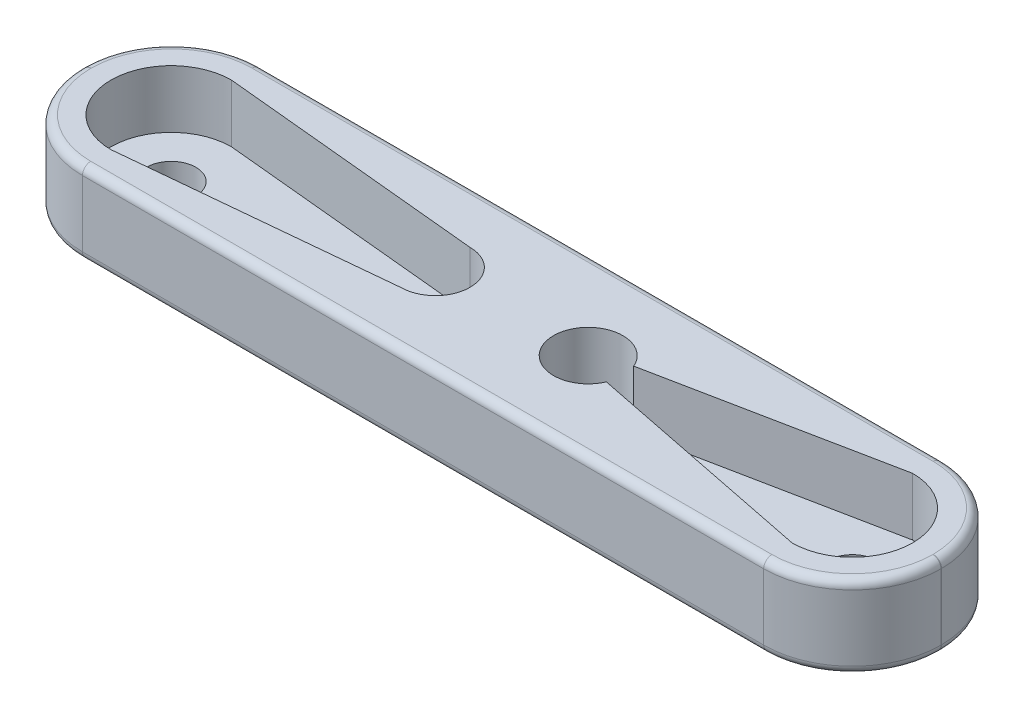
ISO-10303-21;
HEADER;
FILE_DESCRIPTION(('STEP AP214'),'2;1');
FILE_NAME('part.step','',(''),(''),'','','');
FILE_SCHEMA(('AUTOMOTIVE_DESIGN { 1 0 10303 214 1 1 1 1 }'));
ENDSEC;
DATA;
#1=APPLICATION_CONTEXT('core data for automotive mechanical design processes');
#2=APPLICATION_PROTOCOL_DEFINITION('international standard','automotive_design',2000,#1);
#3=PRODUCT_CONTEXT('',#1,'mechanical');
#4=PRODUCT('Part','Part','',(#3));
#5=PRODUCT_RELATED_PRODUCT_CATEGORY('part','',(#4));
#6=PRODUCT_DEFINITION_FORMATION('','',#4);
#7=PRODUCT_DEFINITION_CONTEXT('part definition',#1,'design');
#8=PRODUCT_DEFINITION('design','',#6,#7);
#9=PRODUCT_DEFINITION_SHAPE('','',#8);
#10=(LENGTH_UNIT() NAMED_UNIT(*) SI_UNIT(.MILLI.,.METRE.));
#11=(NAMED_UNIT(*) PLANE_ANGLE_UNIT() SI_UNIT($,.RADIAN.));
#12=(NAMED_UNIT(*) SI_UNIT($,.STERADIAN.) SOLID_ANGLE_UNIT());
#13=UNCERTAINTY_MEASURE_WITH_UNIT(LENGTH_MEASURE(1.E-05),#10,'distance_accuracy_value','');
#14=(GEOMETRIC_REPRESENTATION_CONTEXT(3) GLOBAL_UNCERTAINTY_ASSIGNED_CONTEXT((#13)) GLOBAL_UNIT_ASSIGNED_CONTEXT((#10,
#11,#12)) REPRESENTATION_CONTEXT('',''));
#15=CARTESIAN_POINT('',(0.,0.,0.));
#16=DIRECTION('',(0.,0.,1.));
#17=DIRECTION('',(1.,0.,0.));
#18=AXIS2_PLACEMENT_3D('',#15,#16,#17);
#19=CARTESIAN_POINT('',(0.,5.,0.));
#20=DIRECTION('',(0.,-1.,0.));
#21=DIRECTION('',(0.,0.,-1.));
#22=AXIS2_PLACEMENT_3D('',#19,#20,#21);
#23=PLANE('',#22);
#24=DIRECTION('',(0.,0.,1.));
#25=VECTOR('',#24,1.);
#26=CARTESIAN_POINT('',(-25.5,5.,0.));
#27=LINE('',#26,#25);
#28=CARTESIAN_POINT('',(-25.5,5.,-0.015000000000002));
#29=VERTEX_POINT('',#28);
#30=CARTESIAN_POINT('',(-25.5,5.,0.0150000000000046));
#31=VERTEX_POINT('',#30);
#32=EDGE_CURVE('E51',#29,#31,#27,.T.);
#33=ORIENTED_EDGE('',*,*,#32,.T.);
#34=CARTESIAN_POINT('',(-20.63,5.,0.0150000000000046));
#35=DIRECTION('',(0.,-1.,0.));
#36=DIRECTION('',(0.,0.,-1.));
#37=AXIS2_PLACEMENT_3D('',#34,#35,#36);
#38=CIRCLE('',#37,4.87);
#39=CARTESIAN_POINT('',(-20.63,5.,4.885));
#40=VERTEX_POINT('',#39);
#41=EDGE_CURVE('E344',#31,#40,#38,.F.);
#42=ORIENTED_EDGE('',*,*,#41,.T.);
#43=DIRECTION('',(1.,0.,0.));
#44=VECTOR('',#43,1.);
#45=CARTESIAN_POINT('',(0.,5.,4.885));
#46=LINE('',#45,#44);
#47=CARTESIAN_POINT('',(20.63,5.,4.885));
#48=VERTEX_POINT('',#47);
#49=EDGE_CURVE('E332',#40,#48,#46,.T.);
#50=ORIENTED_EDGE('',*,*,#49,.T.);
#51=CARTESIAN_POINT('',(20.63,5.,0.0149999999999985));
#52=DIRECTION('',(0.,-1.,0.));
#53=DIRECTION('',(0.,0.,-1.));
#54=AXIS2_PLACEMENT_3D('',#51,#52,#53);
#55=CIRCLE('',#54,4.87);
#56=CARTESIAN_POINT('',(25.5,5.,0.0149999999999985));
#57=VERTEX_POINT('',#56);
#58=EDGE_CURVE('E334',#48,#57,#55,.F.);
#59=ORIENTED_EDGE('',*,*,#58,.T.);
#60=DIRECTION('',(0.,0.,-1.));
#61=VECTOR('',#60,1.);
#62=CARTESIAN_POINT('',(25.5,5.,0.));
#63=LINE('',#62,#61);
#64=CARTESIAN_POINT('',(25.5,5.,-0.015000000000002));
#65=VERTEX_POINT('',#64);
#66=EDGE_CURVE('E336',#57,#65,#63,.T.);
#67=ORIENTED_EDGE('',*,*,#66,.T.);
#68=CARTESIAN_POINT('',(20.63,5.,-0.015000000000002));
#69=DIRECTION('',(0.,-1.,0.));
#70=DIRECTION('',(0.,0.,-1.));
#71=AXIS2_PLACEMENT_3D('',#68,#69,#70);
#72=CIRCLE('',#71,4.87);
#73=CARTESIAN_POINT('',(20.63,5.,-4.885));
#74=VERTEX_POINT('',#73);
#75=EDGE_CURVE('E338',#65,#74,#72,.F.);
#76=ORIENTED_EDGE('',*,*,#75,.T.);
#77=DIRECTION('',(-1.,0.,0.));
#78=VECTOR('',#77,1.);
#79=CARTESIAN_POINT('',(0.,5.,-4.885));
#80=LINE('',#79,#78);
#81=CARTESIAN_POINT('',(-20.63,5.,-4.885));
#82=VERTEX_POINT('',#81);
#83=EDGE_CURVE('E340',#74,#82,#80,.T.);
#84=ORIENTED_EDGE('',*,*,#83,.T.);
#85=CARTESIAN_POINT('',(-20.63,5.,-0.015000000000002));
#86=DIRECTION('',(0.,-1.,0.));
#87=DIRECTION('',(0.,0.,-1.));
#88=AXIS2_PLACEMENT_3D('',#85,#86,#87);
#89=CIRCLE('',#88,4.87);
#90=EDGE_CURVE('E56',#82,#29,#89,.F.);
#91=ORIENTED_EDGE('',*,*,#90,.T.);
#92=EDGE_LOOP('',(#33,#42,#50,#59,#67,#76,#84,#91));
#93=FACE_BOUND('',#92,.T.);
#94=CARTESIAN_POINT('',(-4.63000000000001,5.,0.0150000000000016));
#95=DIRECTION('',(0.,1.,0.));
#96=DIRECTION('',(0.,0.,1.));
#97=AXIS2_PLACEMENT_3D('',#94,#95,#96);
#98=CIRCLE('',#97,2.1);
#99=CARTESIAN_POINT('',(-4.63000000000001,5.,2.115));
#100=VERTEX_POINT('',#99);
#101=CARTESIAN_POINT('',(-4.63000000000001,5.,-2.085));
#102=VERTEX_POINT('',#101);
#103=EDGE_CURVE('E223',#100,#102,#98,.T.);
#104=ORIENTED_EDGE('',*,*,#103,.F.);
#105=DIRECTION('',(-0.995340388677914,0.,0.0964236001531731));
#106=VECTOR('',#105,1.);
#107=CARTESIAN_POINT('',(0.159938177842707,5.,1.65097473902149));
#108=LINE('',#107,#106);
#109=CARTESIAN_POINT('',(-20.63,5.,3.665));
#110=VERTEX_POINT('',#109);
#111=EDGE_CURVE('E214',#100,#110,#108,.T.);
#112=ORIENTED_EDGE('',*,*,#111,.T.);
#113=CARTESIAN_POINT('',(-20.63,5.,0.0150000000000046));
#114=DIRECTION('',(0.,1.,0.));
#115=DIRECTION('',(0.,0.,1.));
#116=AXIS2_PLACEMENT_3D('',#113,#114,#115);
#117=CIRCLE('',#116,3.65);
#118=CARTESIAN_POINT('',(-20.63,5.,-3.635));
#119=VERTEX_POINT('',#118);
#120=EDGE_CURVE('E208',#119,#110,#117,.T.);
#121=ORIENTED_EDGE('',*,*,#120,.F.);
#122=DIRECTION('',(0.995340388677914,0.,0.0964236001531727));
#123=VECTOR('',#122,1.);
#124=CARTESIAN_POINT('',(0.157058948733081,5.,-1.62125366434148));
#125=LINE('',#124,#123);
#126=EDGE_CURVE('E261',#119,#102,#125,.T.);
#127=ORIENTED_EDGE('',*,*,#126,.T.);
#128=EDGE_LOOP('',(#104,#112,#121,#127));
#129=FACE_BOUND('',#128,.T.);
#130=CARTESIAN_POINT('',(4.62999999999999,5.,0.0150000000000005));
#131=DIRECTION('',(0.,1.,0.));
#132=DIRECTION('',(0.,0.,1.));
#133=AXIS2_PLACEMENT_3D('',#130,#131,#132);
#134=CIRCLE('',#133,2.1);
#135=CARTESIAN_POINT('',(6.56001136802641,5.,-0.812681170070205));
#136=VERTEX_POINT('',#135);
#137=CARTESIAN_POINT('',(6.56001136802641,5.,0.842681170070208));
#138=VERTEX_POINT('',#137);
#139=EDGE_CURVE('E237',#136,#138,#134,.T.);
#140=ORIENTED_EDGE('',*,*,#139,.F.);
#141=DIRECTION('',(-0.980469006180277,0.,0.196673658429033));
#142=VECTOR('',#141,1.);
#143=CARTESIAN_POINT('',(0.0970334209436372,5.,0.483736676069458));
#144=LINE('',#143,#142);
#145=CARTESIAN_POINT('',(20.63,5.,-3.635));
#146=VERTEX_POINT('',#145);
#147=EDGE_CURVE('E255',#146,#136,#144,.T.);
#148=ORIENTED_EDGE('',*,*,#147,.F.);
#149=CARTESIAN_POINT('',(20.63,5.,0.0149999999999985));
#150=DIRECTION('',(0.,1.,0.));
#151=DIRECTION('',(0.,0.,1.));
#152=AXIS2_PLACEMENT_3D('',#149,#150,#151);
#153=CIRCLE('',#152,3.65);
#154=CARTESIAN_POINT('',(20.63,5.,3.665));
#155=VERTEX_POINT('',#154);
#156=EDGE_CURVE('E273',#155,#146,#153,.T.);
#157=ORIENTED_EDGE('',*,*,#156,.F.);
#158=DIRECTION('',(-0.980469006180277,0.,-0.196673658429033));
#159=VECTOR('',#158,1.);
#160=CARTESIAN_POINT('',(0.0912484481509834,5.,-0.454897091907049));
#161=LINE('',#160,#159);
#162=EDGE_CURVE('E280',#155,#138,#161,.T.);
#163=ORIENTED_EDGE('',*,*,#162,.T.);
#164=EDGE_LOOP('',(#140,#148,#157,#163));
#165=FACE_BOUND('',#164,.T.);
#166=ADVANCED_FACE('F34',(#93,#129,#165),#23,.F.);
#167=CARTESIAN_POINT('',(-26.,5.,-5.385));
#168=DIRECTION('',(0.,0.,1.));
#169=DIRECTION('',(1.,0.,0.));
#170=AXIS2_PLACEMENT_3D('',#167,#168,#169);
#171=PLANE('',#170);
#172=DIRECTION('',(0.,1.,0.));
#173=VECTOR('',#172,1.);
#174=CARTESIAN_POINT('',(20.63,0.,-5.385));
#175=LINE('',#174,#173);
#176=CARTESIAN_POINT('',(20.63,0.5,-5.385));
#177=VERTEX_POINT('',#176);
#178=CARTESIAN_POINT('',(20.63,4.5,-5.385));
#179=VERTEX_POINT('',#178);
#180=EDGE_CURVE('E408',#177,#179,#175,.T.);
#181=ORIENTED_EDGE('',*,*,#180,.F.);
#182=DIRECTION('',(-1.,0.,0.));
#183=VECTOR('',#182,1.);
#184=CARTESIAN_POINT('',(-20.63,0.5,-5.385));
#185=LINE('',#184,#183);
#186=CARTESIAN_POINT('',(-20.63,0.5,-5.385));
#187=VERTEX_POINT('',#186);
#188=EDGE_CURVE('E318',#177,#187,#185,.T.);
#189=ORIENTED_EDGE('',*,*,#188,.T.);
#190=DIRECTION('',(0.,1.,0.));
#191=VECTOR('',#190,1.);
#192=CARTESIAN_POINT('',(-20.63,0.,-5.385));
#193=LINE('',#192,#191);
#194=CARTESIAN_POINT('',(-20.63,4.5,-5.385));
#195=VERTEX_POINT('',#194);
#196=EDGE_CURVE('E228',#187,#195,#193,.T.);
#197=ORIENTED_EDGE('',*,*,#196,.T.);
#198=DIRECTION('',(-1.,0.,0.));
#199=VECTOR('',#198,1.);
#200=CARTESIAN_POINT('',(-26.,4.5,-5.385));
#201=LINE('',#200,#199);
#202=EDGE_CURVE('E316',#195,#179,#201,.F.);
#203=ORIENTED_EDGE('',*,*,#202,.T.);
#204=EDGE_LOOP('',(#181,#189,#197,#203));
#205=FACE_BOUND('',#204,.T.);
#206=ADVANCED_FACE('F504',(#205),#171,.F.);
#207=CARTESIAN_POINT('',(-26.,5.,5.385));
#208=DIRECTION('',(1.,0.,0.));
#209=DIRECTION('',(0.,0.,-1.));
#210=AXIS2_PLACEMENT_3D('',#207,#208,#209);
#211=PLANE('',#210);
#212=DIRECTION('',(0.,1.,0.));
#213=VECTOR('',#212,1.);
#214=CARTESIAN_POINT('',(-26.,0.,-0.015000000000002));
#215=LINE('',#214,#213);
#216=CARTESIAN_POINT('',(-26.,0.5,-0.015000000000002));
#217=VERTEX_POINT('',#216);
#218=CARTESIAN_POINT('',(-26.,4.5,-0.015000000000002));
#219=VERTEX_POINT('',#218);
#220=EDGE_CURVE('E240',#217,#219,#215,.T.);
#221=ORIENTED_EDGE('',*,*,#220,.F.);
#222=DIRECTION('',(0.,0.,1.));
#223=VECTOR('',#222,1.);
#224=CARTESIAN_POINT('',(-26.,0.5,0.0150000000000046));
#225=LINE('',#224,#223);
#226=CARTESIAN_POINT('',(-26.,0.5,0.0150000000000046));
#227=VERTEX_POINT('',#226);
#228=EDGE_CURVE('E310',#217,#227,#225,.T.);
#229=ORIENTED_EDGE('',*,*,#228,.T.);
#230=DIRECTION('',(0.,1.,0.));
#231=VECTOR('',#230,1.);
#232=CARTESIAN_POINT('',(-26.,0.,0.0150000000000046));
#233=LINE('',#232,#231);
#234=CARTESIAN_POINT('',(-26.,4.5,0.0150000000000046));
#235=VERTEX_POINT('',#234);
#236=EDGE_CURVE('E427',#227,#235,#233,.T.);
#237=ORIENTED_EDGE('',*,*,#236,.T.);
#238=DIRECTION('',(0.,0.,1.));
#239=VECTOR('',#238,1.);
#240=CARTESIAN_POINT('',(-26.,4.5,5.385));
#241=LINE('',#240,#239);
#242=EDGE_CURVE('E308',#235,#219,#241,.F.);
#243=ORIENTED_EDGE('',*,*,#242,.T.);
#244=EDGE_LOOP('',(#221,#229,#237,#243));
#245=FACE_BOUND('',#244,.T.);
#246=ADVANCED_FACE('F509',(#245),#211,.F.);
#247=CARTESIAN_POINT('',(-26.,5.,5.385));
#248=DIRECTION('',(0.,0.,-1.));
#249=DIRECTION('',(-1.,0.,0.));
#250=AXIS2_PLACEMENT_3D('',#247,#248,#249);
#251=PLANE('',#250);
#252=DIRECTION('',(0.,1.,0.));
#253=VECTOR('',#252,1.);
#254=CARTESIAN_POINT('',(-20.63,0.,5.385));
#255=LINE('',#254,#253);
#256=CARTESIAN_POINT('',(-20.63,0.5,5.385));
#257=VERTEX_POINT('',#256);
#258=CARTESIAN_POINT('',(-20.63,4.5,5.385));
#259=VERTEX_POINT('',#258);
#260=EDGE_CURVE('E423',#257,#259,#255,.T.);
#261=ORIENTED_EDGE('',*,*,#260,.F.);
#262=DIRECTION('',(1.,0.,0.));
#263=VECTOR('',#262,1.);
#264=CARTESIAN_POINT('',(20.63,0.5,5.385));
#265=LINE('',#264,#263);
#266=CARTESIAN_POINT('',(20.63,0.5,5.385));
#267=VERTEX_POINT('',#266);
#268=EDGE_CURVE('E11',#257,#267,#265,.T.);
#269=ORIENTED_EDGE('',*,*,#268,.T.);
#270=DIRECTION('',(0.,1.,0.));
#271=VECTOR('',#270,1.);
#272=CARTESIAN_POINT('',(20.63,0.,5.385));
#273=LINE('',#272,#271);
#274=CARTESIAN_POINT('',(20.63,4.5,5.385));
#275=VERTEX_POINT('',#274);
#276=EDGE_CURVE('E433',#267,#275,#273,.T.);
#277=ORIENTED_EDGE('',*,*,#276,.T.);
#278=DIRECTION('',(1.,0.,0.));
#279=VECTOR('',#278,1.);
#280=CARTESIAN_POINT('',(-26.,4.5,5.385));
#281=LINE('',#280,#279);
#282=EDGE_CURVE('E43',#275,#259,#281,.F.);
#283=ORIENTED_EDGE('',*,*,#282,.T.);
#284=EDGE_LOOP('',(#261,#269,#277,#283));
#285=FACE_BOUND('',#284,.T.);
#286=ADVANCED_FACE('F454',(#285),#251,.F.);
#287=CARTESIAN_POINT('',(0.,0.,0.));
#288=DIRECTION('',(0.,-1.,0.));
#289=DIRECTION('',(0.,0.,-1.));
#290=AXIS2_PLACEMENT_3D('',#287,#288,#289);
#291=PLANE('',#290);
#292=DIRECTION('',(1.,0.,0.));
#293=VECTOR('',#292,1.);
#294=CARTESIAN_POINT('',(-20.63,0.,4.885));
#295=LINE('',#294,#293);
#296=CARTESIAN_POINT('',(20.63,0.,4.885));
#297=VERTEX_POINT('',#296);
#298=CARTESIAN_POINT('',(-20.63,0.,4.885));
#299=VERTEX_POINT('',#298);
#300=EDGE_CURVE('E291',#297,#299,#295,.F.);
#301=ORIENTED_EDGE('',*,*,#300,.T.);
#302=CARTESIAN_POINT('',(-20.63,0.,0.0150000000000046));
#303=DIRECTION('',(0.,-1.,0.));
#304=DIRECTION('',(0.,0.,-1.));
#305=AXIS2_PLACEMENT_3D('',#302,#303,#304);
#306=CIRCLE('',#305,4.87);
#307=CARTESIAN_POINT('',(-25.5,0.,0.0150000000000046));
#308=VERTEX_POINT('',#307);
#309=EDGE_CURVE('E305',#299,#308,#306,.T.);
#310=ORIENTED_EDGE('',*,*,#309,.T.);
#311=DIRECTION('',(0.,0.,1.));
#312=VECTOR('',#311,1.);
#313=CARTESIAN_POINT('',(-25.5,0.,-0.015000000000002));
#314=LINE('',#313,#312);
#315=CARTESIAN_POINT('',(-25.5,0.,-0.015000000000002));
#316=VERTEX_POINT('',#315);
#317=EDGE_CURVE('E303',#308,#316,#314,.F.);
#318=ORIENTED_EDGE('',*,*,#317,.T.);
#319=CARTESIAN_POINT('',(-20.63,0.,-0.015000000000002));
#320=DIRECTION('',(0.,-1.,0.));
#321=DIRECTION('',(0.,0.,-1.));
#322=AXIS2_PLACEMENT_3D('',#319,#320,#321);
#323=CIRCLE('',#322,4.87);
#324=CARTESIAN_POINT('',(-20.63,0.,-4.885));
#325=VERTEX_POINT('',#324);
#326=EDGE_CURVE('E301',#316,#325,#323,.T.);
#327=ORIENTED_EDGE('',*,*,#326,.T.);
#328=DIRECTION('',(-1.,0.,0.));
#329=VECTOR('',#328,1.);
#330=CARTESIAN_POINT('',(20.63,0.,-4.885));
#331=LINE('',#330,#329);
#332=CARTESIAN_POINT('',(20.63,0.,-4.885));
#333=VERTEX_POINT('',#332);
#334=EDGE_CURVE('E299',#325,#333,#331,.F.);
#335=ORIENTED_EDGE('',*,*,#334,.T.);
#336=CARTESIAN_POINT('',(20.63,0.,-0.015000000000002));
#337=DIRECTION('',(0.,-1.,0.));
#338=DIRECTION('',(0.,0.,-1.));
#339=AXIS2_PLACEMENT_3D('',#336,#337,#338);
#340=CIRCLE('',#339,4.87);
#341=CARTESIAN_POINT('',(25.5,0.,-0.015000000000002));
#342=VERTEX_POINT('',#341);
#343=EDGE_CURVE('E297',#333,#342,#340,.T.);
#344=ORIENTED_EDGE('',*,*,#343,.T.);
#345=DIRECTION('',(0.,0.,-1.));
#346=VECTOR('',#345,1.);
#347=CARTESIAN_POINT('',(25.5,0.,0.0149999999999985));
#348=LINE('',#347,#346);
#349=CARTESIAN_POINT('',(25.5,0.,0.0149999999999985));
#350=VERTEX_POINT('',#349);
#351=EDGE_CURVE('E295',#342,#350,#348,.F.);
#352=ORIENTED_EDGE('',*,*,#351,.T.);
#353=CARTESIAN_POINT('',(20.63,0.,0.0149999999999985));
#354=DIRECTION('',(0.,-1.,0.));
#355=DIRECTION('',(0.,0.,-1.));
#356=AXIS2_PLACEMENT_3D('',#353,#354,#355);
#357=CIRCLE('',#356,4.87);
#358=EDGE_CURVE('E293',#350,#297,#357,.T.);
#359=ORIENTED_EDGE('',*,*,#358,.T.);
#360=EDGE_LOOP('',(#301,#310,#318,#327,#335,#344,#352,#359));
#361=FACE_BOUND('',#360,.T.);
#362=CARTESIAN_POINT('',(-20.63,0.,0.0150000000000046));
#363=DIRECTION('',(0.,1.,0.));
#364=DIRECTION('',(0.,0.,1.));
#365=AXIS2_PLACEMENT_3D('',#362,#363,#364);
#366=CIRCLE('',#365,1.5);
#367=CARTESIAN_POINT('',(-20.63,0.,1.51500000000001));
#368=VERTEX_POINT('',#367);
#369=EDGE_CURVE('E245',#368,#368,#366,.T.);
#370=ORIENTED_EDGE('',*,*,#369,.T.);
#371=EDGE_LOOP('',(#370));
#372=FACE_BOUND('',#371,.T.);
#373=CARTESIAN_POINT('',(20.63,0.,0.0149999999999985));
#374=DIRECTION('',(0.,1.,0.));
#375=DIRECTION('',(0.,0.,1.));
#376=AXIS2_PLACEMENT_3D('',#373,#374,#375);
#377=CIRCLE('',#376,1.5);
#378=CARTESIAN_POINT('',(20.63,0.,1.515));
#379=VERTEX_POINT('',#378);
#380=EDGE_CURVE('E231',#379,#379,#377,.T.);
#381=ORIENTED_EDGE('',*,*,#380,.T.);
#382=EDGE_LOOP('',(#381));
#383=FACE_BOUND('',#382,.T.);
#384=ADVANCED_FACE('F467',(#361,#372,#383),#291,.T.);
#385=CARTESIAN_POINT('',(26.,5.,5.385));
#386=DIRECTION('',(-1.,0.,0.));
#387=DIRECTION('',(0.,0.,1.));
#388=AXIS2_PLACEMENT_3D('',#385,#386,#387);
#389=PLANE('',#388);
#390=DIRECTION('',(0.,1.,0.));
#391=VECTOR('',#390,1.);
#392=CARTESIAN_POINT('',(26.,0.,0.0149999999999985));
#393=LINE('',#392,#391);
#394=CARTESIAN_POINT('',(26.,0.5,0.0149999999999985));
#395=VERTEX_POINT('',#394);
#396=CARTESIAN_POINT('',(26.,4.5,0.0149999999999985));
#397=VERTEX_POINT('',#396);
#398=EDGE_CURVE('E415',#395,#397,#393,.T.);
#399=ORIENTED_EDGE('',*,*,#398,.F.);
#400=DIRECTION('',(0.,0.,-1.));
#401=VECTOR('',#400,1.);
#402=CARTESIAN_POINT('',(26.,0.5,-0.015000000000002));
#403=LINE('',#402,#401);
#404=CARTESIAN_POINT('',(26.,0.5,-0.015000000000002));
#405=VERTEX_POINT('',#404);
#406=EDGE_CURVE('E326',#395,#405,#403,.T.);
#407=ORIENTED_EDGE('',*,*,#406,.T.);
#408=DIRECTION('',(0.,1.,0.));
#409=VECTOR('',#408,1.);
#410=CARTESIAN_POINT('',(26.,0.,-0.015000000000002));
#411=LINE('',#410,#409);
#412=CARTESIAN_POINT('',(26.,4.5,-0.015000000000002));
#413=VERTEX_POINT('',#412);
#414=EDGE_CURVE('E369',#405,#413,#411,.T.);
#415=ORIENTED_EDGE('',*,*,#414,.T.);
#416=DIRECTION('',(0.,0.,-1.));
#417=VECTOR('',#416,1.);
#418=CARTESIAN_POINT('',(26.,4.5,5.385));
#419=LINE('',#418,#417);
#420=EDGE_CURVE('E324',#413,#397,#419,.F.);
#421=ORIENTED_EDGE('',*,*,#420,.T.);
#422=EDGE_LOOP('',(#399,#407,#415,#421));
#423=FACE_BOUND('',#422,.T.);
#424=ADVANCED_FACE('F411',(#423),#389,.F.);
#425=CARTESIAN_POINT('',(0.0970334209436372,1.5,0.483736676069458));
#426=DIRECTION('',(-0.196673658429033,0.,-0.980469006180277));
#427=DIRECTION('',(-0.980469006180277,0.,0.196673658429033));
#428=AXIS2_PLACEMENT_3D('',#425,#426,#427);
#429=PLANE('',#428);
#430=ORIENTED_EDGE('',*,*,#147,.T.);
#431=DIRECTION('',(0.,1.,0.));
#432=VECTOR('',#431,1.);
#433=CARTESIAN_POINT('',(6.56001136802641,1.5,-0.812681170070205));
#434=LINE('',#433,#432);
#435=CARTESIAN_POINT('',(6.56001136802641,1.5,-0.812681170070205));
#436=VERTEX_POINT('',#435);
#437=EDGE_CURVE('E225',#436,#136,#434,.T.);
#438=ORIENTED_EDGE('',*,*,#437,.F.);
#439=DIRECTION('',(-0.980469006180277,0.,0.196673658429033));
#440=VECTOR('',#439,1.);
#441=CARTESIAN_POINT('',(0.0970334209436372,1.5,0.483736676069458));
#442=LINE('',#441,#440);
#443=CARTESIAN_POINT('',(20.63,1.5,-3.635));
#444=VERTEX_POINT('',#443);
#445=EDGE_CURVE('E270',#444,#436,#442,.T.);
#446=ORIENTED_EDGE('',*,*,#445,.F.);
#447=DIRECTION('',(0.,1.,0.));
#448=VECTOR('',#447,1.);
#449=CARTESIAN_POINT('',(20.63,1.5,-3.635));
#450=LINE('',#449,#448);
#451=EDGE_CURVE('E262',#444,#146,#450,.T.);
#452=ORIENTED_EDGE('',*,*,#451,.T.);
#453=EDGE_LOOP('',(#430,#438,#446,#452));
#454=FACE_BOUND('',#453,.T.);
#455=ADVANCED_FACE('F514',(#454),#429,.F.);
#456=CARTESIAN_POINT('',(20.63,1.5,0.0149999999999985));
#457=DIRECTION('',(0.,1.,0.));
#458=DIRECTION('',(0.,0.,1.));
#459=AXIS2_PLACEMENT_3D('',#456,#457,#458);
#460=CYLINDRICAL_SURFACE('',#459,3.65);
#461=ORIENTED_EDGE('',*,*,#156,.T.);
#462=ORIENTED_EDGE('',*,*,#451,.F.);
#463=CARTESIAN_POINT('',(20.63,1.5,0.0149999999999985));
#464=DIRECTION('',(0.,1.,0.));
#465=DIRECTION('',(0.,0.,1.));
#466=AXIS2_PLACEMENT_3D('',#463,#464,#465);
#467=CIRCLE('',#466,3.65);
#468=CARTESIAN_POINT('',(20.63,1.5,3.665));
#469=VERTEX_POINT('',#468);
#470=EDGE_CURVE('E274',#469,#444,#467,.T.);
#471=ORIENTED_EDGE('',*,*,#470,.F.);
#472=DIRECTION('',(0.,1.,0.));
#473=VECTOR('',#472,1.);
#474=CARTESIAN_POINT('',(20.63,1.5,3.665));
#475=LINE('',#474,#473);
#476=EDGE_CURVE('E277',#469,#155,#475,.T.);
#477=ORIENTED_EDGE('',*,*,#476,.T.);
#478=EDGE_LOOP('',(#461,#462,#471,#477));
#479=FACE_BOUND('',#478,.T.);
#480=ADVANCED_FACE('F774',(#479),#460,.F.);
#481=CARTESIAN_POINT('',(0.0912484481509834,1.5,-0.454897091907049));
#482=DIRECTION('',(0.196673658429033,0.,-0.980469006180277));
#483=DIRECTION('',(-0.980469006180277,0.,-0.196673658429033));
#484=AXIS2_PLACEMENT_3D('',#481,#482,#483);
#485=PLANE('',#484);
#486=ORIENTED_EDGE('',*,*,#162,.F.);
#487=ORIENTED_EDGE('',*,*,#476,.F.);
#488=DIRECTION('',(-0.980469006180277,0.,-0.196673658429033));
#489=VECTOR('',#488,1.);
#490=CARTESIAN_POINT('',(0.0912484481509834,1.5,-0.454897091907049));
#491=LINE('',#490,#489);
#492=CARTESIAN_POINT('',(6.56001136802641,1.5,0.842681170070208));
#493=VERTEX_POINT('',#492);
#494=EDGE_CURVE('E272',#469,#493,#491,.T.);
#495=ORIENTED_EDGE('',*,*,#494,.T.);
#496=DIRECTION('',(0.,1.,0.));
#497=VECTOR('',#496,1.);
#498=CARTESIAN_POINT('',(6.56001136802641,1.5,0.842681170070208));
#499=LINE('',#498,#497);
#500=EDGE_CURVE('E236',#493,#138,#499,.T.);
#501=ORIENTED_EDGE('',*,*,#500,.T.);
#502=EDGE_LOOP('',(#486,#487,#495,#501));
#503=FACE_BOUND('',#502,.T.);
#504=ADVANCED_FACE('F762',(#503),#485,.T.);
#505=CARTESIAN_POINT('',(0.,1.5,0.));
#506=DIRECTION('',(0.,1.,0.));
#507=DIRECTION('',(0.,0.,1.));
#508=AXIS2_PLACEMENT_3D('',#505,#506,#507);
#509=PLANE('',#508);
#510=ORIENTED_EDGE('',*,*,#445,.T.);
#511=CARTESIAN_POINT('',(4.62999999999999,1.5,0.0150000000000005));
#512=DIRECTION('',(0.,1.,0.));
#513=DIRECTION('',(0.,0.,1.));
#514=AXIS2_PLACEMENT_3D('',#511,#512,#513);
#515=CIRCLE('',#514,2.1);
#516=EDGE_CURVE('E233',#436,#493,#515,.T.);
#517=ORIENTED_EDGE('',*,*,#516,.T.);
#518=ORIENTED_EDGE('',*,*,#494,.F.);
#519=ORIENTED_EDGE('',*,*,#470,.T.);
#520=EDGE_LOOP('',(#510,#517,#518,#519));
#521=FACE_BOUND('',#520,.T.);
#522=CARTESIAN_POINT('',(20.63,1.5,0.0149999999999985));
#523=DIRECTION('',(0.,1.,0.));
#524=DIRECTION('',(0.,0.,1.));
#525=AXIS2_PLACEMENT_3D('',#522,#523,#524);
#526=CIRCLE('',#525,1.5);
#527=CARTESIAN_POINT('',(20.63,1.5,1.515));
#528=VERTEX_POINT('',#527);
#529=EDGE_CURVE('E253',#528,#528,#526,.T.);
#530=ORIENTED_EDGE('',*,*,#529,.F.);
#531=EDGE_LOOP('',(#530));
#532=FACE_BOUND('',#531,.T.);
#533=ADVANCED_FACE('F751',(#521,#532),#509,.T.);
#534=CARTESIAN_POINT('',(0.159938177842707,1.5,1.65097473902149));
#535=DIRECTION('',(-0.0964236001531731,0.,-0.995340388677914));
#536=DIRECTION('',(-0.995340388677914,0.,0.0964236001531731));
#537=AXIS2_PLACEMENT_3D('',#534,#535,#536);
#538=PLANE('',#537);
#539=ORIENTED_EDGE('',*,*,#111,.F.);
#540=DIRECTION('',(0.,1.,0.));
#541=VECTOR('',#540,1.);
#542=CARTESIAN_POINT('',(-4.63000000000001,1.5,2.115));
#543=LINE('',#542,#541);
#544=CARTESIAN_POINT('',(-4.63000000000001,1.5,2.115));
#545=VERTEX_POINT('',#544);
#546=EDGE_CURVE('E211',#545,#100,#543,.T.);
#547=ORIENTED_EDGE('',*,*,#546,.F.);
#548=DIRECTION('',(-0.995340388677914,0.,0.0964236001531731));
#549=VECTOR('',#548,1.);
#550=CARTESIAN_POINT('',(0.159938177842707,1.5,1.65097473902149));
#551=LINE('',#550,#549);
#552=CARTESIAN_POINT('',(-20.63,1.5,3.665));
#553=VERTEX_POINT('',#552);
#554=EDGE_CURVE('E196',#545,#553,#551,.T.);
#555=ORIENTED_EDGE('',*,*,#554,.T.);
#556=DIRECTION('',(0.,1.,0.));
#557=VECTOR('',#556,1.);
#558=CARTESIAN_POINT('',(-20.63,1.5,3.665));
#559=LINE('',#558,#557);
#560=EDGE_CURVE('E266',#553,#110,#559,.T.);
#561=ORIENTED_EDGE('',*,*,#560,.T.);
#562=EDGE_LOOP('',(#539,#547,#555,#561));
#563=FACE_BOUND('',#562,.T.);
#564=ADVANCED_FACE('F212',(#563),#538,.T.);
#565=CARTESIAN_POINT('',(-20.63,1.5,0.0150000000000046));
#566=DIRECTION('',(0.,1.,0.));
#567=DIRECTION('',(0.,0.,1.));
#568=AXIS2_PLACEMENT_3D('',#565,#566,#567);
#569=CYLINDRICAL_SURFACE('',#568,3.65);
#570=ORIENTED_EDGE('',*,*,#120,.T.);
#571=ORIENTED_EDGE('',*,*,#560,.F.);
#572=CARTESIAN_POINT('',(-20.63,1.5,0.0150000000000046));
#573=DIRECTION('',(0.,1.,0.));
#574=DIRECTION('',(0.,0.,1.));
#575=AXIS2_PLACEMENT_3D('',#572,#573,#574);
#576=CIRCLE('',#575,3.65);
#577=CARTESIAN_POINT('',(-20.63,1.5,-3.635));
#578=VERTEX_POINT('',#577);
#579=EDGE_CURVE('E204',#578,#553,#576,.T.);
#580=ORIENTED_EDGE('',*,*,#579,.F.);
#581=DIRECTION('',(0.,1.,0.));
#582=VECTOR('',#581,1.);
#583=CARTESIAN_POINT('',(-20.63,1.5,-3.635));
#584=LINE('',#583,#582);
#585=EDGE_CURVE('E258',#578,#119,#584,.T.);
#586=ORIENTED_EDGE('',*,*,#585,.T.);
#587=EDGE_LOOP('',(#570,#571,#580,#586));
#588=FACE_BOUND('',#587,.T.);
#589=ADVANCED_FACE('F738',(#588),#569,.F.);
#590=CARTESIAN_POINT('',(0.157058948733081,1.5,-1.62125366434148));
#591=DIRECTION('',(-0.0964236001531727,0.,0.995340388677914));
#592=DIRECTION('',(0.995340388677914,0.,0.0964236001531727));
#593=AXIS2_PLACEMENT_3D('',#590,#591,#592);
#594=PLANE('',#593);
#595=ORIENTED_EDGE('',*,*,#126,.F.);
#596=ORIENTED_EDGE('',*,*,#585,.F.);
#597=DIRECTION('',(0.995340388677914,0.,0.0964236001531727));
#598=VECTOR('',#597,1.);
#599=CARTESIAN_POINT('',(0.157058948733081,1.5,-1.62125366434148));
#600=LINE('',#599,#598);
#601=CARTESIAN_POINT('',(-4.63000000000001,1.5,-2.085));
#602=VERTEX_POINT('',#601);
#603=EDGE_CURVE('E207',#578,#602,#600,.T.);
#604=ORIENTED_EDGE('',*,*,#603,.T.);
#605=DIRECTION('',(0.,1.,0.));
#606=VECTOR('',#605,1.);
#607=CARTESIAN_POINT('',(-4.63000000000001,1.5,-2.085));
#608=LINE('',#607,#606);
#609=EDGE_CURVE('E218',#602,#102,#608,.T.);
#610=ORIENTED_EDGE('',*,*,#609,.T.);
#611=EDGE_LOOP('',(#595,#596,#604,#610));
#612=FACE_BOUND('',#611,.T.);
#613=ADVANCED_FACE('F726',(#612),#594,.T.);
#614=CARTESIAN_POINT('',(0.,1.5,0.));
#615=DIRECTION('',(0.,1.,0.));
#616=DIRECTION('',(0.,0.,1.));
#617=AXIS2_PLACEMENT_3D('',#614,#615,#616);
#618=PLANE('',#617);
#619=ORIENTED_EDGE('',*,*,#554,.F.);
#620=CARTESIAN_POINT('',(-4.63000000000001,1.5,0.0150000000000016));
#621=DIRECTION('',(0.,1.,0.));
#622=DIRECTION('',(0.,0.,1.));
#623=AXIS2_PLACEMENT_3D('',#620,#621,#622);
#624=CIRCLE('',#623,2.1);
#625=EDGE_CURVE('E202',#545,#602,#624,.T.);
#626=ORIENTED_EDGE('',*,*,#625,.T.);
#627=ORIENTED_EDGE('',*,*,#603,.F.);
#628=ORIENTED_EDGE('',*,*,#579,.T.);
#629=EDGE_LOOP('',(#619,#626,#627,#628));
#630=FACE_BOUND('',#629,.T.);
#631=CARTESIAN_POINT('',(-20.63,1.5,0.0150000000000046));
#632=DIRECTION('',(0.,1.,0.));
#633=DIRECTION('',(0.,0.,1.));
#634=AXIS2_PLACEMENT_3D('',#631,#632,#633);
#635=CIRCLE('',#634,1.5);
#636=CARTESIAN_POINT('',(-20.63,1.5,1.51500000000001));
#637=VERTEX_POINT('',#636);
#638=EDGE_CURVE('E248',#637,#637,#635,.T.);
#639=ORIENTED_EDGE('',*,*,#638,.F.);
#640=EDGE_LOOP('',(#639));
#641=FACE_BOUND('',#640,.T.);
#642=ADVANCED_FACE('F198',(#630,#641),#618,.T.);
#643=CARTESIAN_POINT('',(-20.63,0.,0.0150000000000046));
#644=DIRECTION('',(0.,1.,0.));
#645=DIRECTION('',(0.,0.,1.));
#646=AXIS2_PLACEMENT_3D('',#643,#644,#645);
#647=CYLINDRICAL_SURFACE('',#646,1.5);
#648=ORIENTED_EDGE('',*,*,#638,.T.);
#649=EDGE_LOOP('',(#648));
#650=FACE_BOUND('',#649,.T.);
#651=ORIENTED_EDGE('',*,*,#369,.F.);
#652=EDGE_LOOP('',(#651));
#653=FACE_BOUND('',#652,.T.);
#654=ADVANCED_FACE('F725',(#650,#653),#647,.F.);
#655=CARTESIAN_POINT('',(20.63,0.,0.0149999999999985));
#656=DIRECTION('',(0.,1.,0.));
#657=DIRECTION('',(0.,0.,1.));
#658=AXIS2_PLACEMENT_3D('',#655,#656,#657);
#659=CYLINDRICAL_SURFACE('',#658,1.5);
#660=ORIENTED_EDGE('',*,*,#529,.T.);
#661=EDGE_LOOP('',(#660));
#662=FACE_BOUND('',#661,.T.);
#663=ORIENTED_EDGE('',*,*,#380,.F.);
#664=EDGE_LOOP('',(#663));
#665=FACE_BOUND('',#664,.T.);
#666=ADVANCED_FACE('F716',(#662,#665),#659,.F.);
#667=CARTESIAN_POINT('',(-4.63000000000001,1.5,0.0150000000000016));
#668=DIRECTION('',(0.,1.,0.));
#669=DIRECTION('',(0.,0.,1.));
#670=AXIS2_PLACEMENT_3D('',#667,#668,#669);
#671=CYLINDRICAL_SURFACE('',#670,2.1);
#672=ORIENTED_EDGE('',*,*,#103,.T.);
#673=ORIENTED_EDGE('',*,*,#609,.F.);
#674=ORIENTED_EDGE('',*,*,#625,.F.);
#675=ORIENTED_EDGE('',*,*,#546,.T.);
#676=EDGE_LOOP('',(#672,#673,#674,#675));
#677=FACE_BOUND('',#676,.T.);
#678=ADVANCED_FACE('F221',(#677),#671,.F.);
#679=CARTESIAN_POINT('',(4.62999999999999,1.5,0.0150000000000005));
#680=DIRECTION('',(0.,1.,0.));
#681=DIRECTION('',(0.,0.,1.));
#682=AXIS2_PLACEMENT_3D('',#679,#680,#681);
#683=CYLINDRICAL_SURFACE('',#682,2.1);
#684=ORIENTED_EDGE('',*,*,#139,.T.);
#685=ORIENTED_EDGE('',*,*,#500,.F.);
#686=ORIENTED_EDGE('',*,*,#516,.F.);
#687=ORIENTED_EDGE('',*,*,#437,.T.);
#688=EDGE_LOOP('',(#684,#685,#686,#687));
#689=FACE_BOUND('',#688,.T.);
#690=ADVANCED_FACE('F675',(#689),#683,.F.);
#691=CARTESIAN_POINT('',(-20.63,0.,-0.015000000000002));
#692=DIRECTION('',(0.,1.,0.));
#693=DIRECTION('',(0.,0.,1.));
#694=AXIS2_PLACEMENT_3D('',#691,#692,#693);
#695=CYLINDRICAL_SURFACE('',#694,5.37);
#696=ORIENTED_EDGE('',*,*,#196,.F.);
#697=CARTESIAN_POINT('',(-20.63,0.5,-0.015000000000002));
#698=DIRECTION('',(0.,-1.,0.));
#699=DIRECTION('',(0.,0.,-1.));
#700=AXIS2_PLACEMENT_3D('',#697,#698,#699);
#701=CIRCLE('',#700,5.37);
#702=EDGE_CURVE('E314',#187,#217,#701,.F.);
#703=ORIENTED_EDGE('',*,*,#702,.T.);
#704=ORIENTED_EDGE('',*,*,#220,.T.);
#705=CARTESIAN_POINT('',(-20.63,4.5,-0.015000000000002));
#706=DIRECTION('',(0.,-1.,0.));
#707=DIRECTION('',(0.,0.,-1.));
#708=AXIS2_PLACEMENT_3D('',#705,#706,#707);
#709=CIRCLE('',#708,5.37);
#710=EDGE_CURVE('E312',#219,#195,#709,.T.);
#711=ORIENTED_EDGE('',*,*,#710,.T.);
#712=EDGE_LOOP('',(#696,#703,#704,#711));
#713=FACE_BOUND('',#712,.T.);
#714=ADVANCED_FACE('F667',(#713),#695,.T.);
#715=CARTESIAN_POINT('',(-20.63,0.,0.0150000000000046));
#716=DIRECTION('',(0.,1.,0.));
#717=DIRECTION('',(0.,0.,1.));
#718=AXIS2_PLACEMENT_3D('',#715,#716,#717);
#719=CYLINDRICAL_SURFACE('',#718,5.37);
#720=ORIENTED_EDGE('',*,*,#236,.F.);
#721=CARTESIAN_POINT('',(-20.63,0.5,0.0150000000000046));
#722=DIRECTION('',(0.,-1.,0.));
#723=DIRECTION('',(0.,0.,-1.));
#724=AXIS2_PLACEMENT_3D('',#721,#722,#723);
#725=CIRCLE('',#724,5.37);
#726=EDGE_CURVE('E288',#227,#257,#725,.F.);
#727=ORIENTED_EDGE('',*,*,#726,.T.);
#728=ORIENTED_EDGE('',*,*,#260,.T.);
#729=CARTESIAN_POINT('',(-20.63,4.5,0.0150000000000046));
#730=DIRECTION('',(0.,-1.,0.));
#731=DIRECTION('',(0.,0.,-1.));
#732=AXIS2_PLACEMENT_3D('',#729,#730,#731);
#733=CIRCLE('',#732,5.37);
#734=EDGE_CURVE('E268',#259,#235,#733,.T.);
#735=ORIENTED_EDGE('',*,*,#734,.T.);
#736=EDGE_LOOP('',(#720,#727,#728,#735));
#737=FACE_BOUND('',#736,.T.);
#738=ADVANCED_FACE('F659',(#737),#719,.T.);
#739=CARTESIAN_POINT('',(20.63,0.,0.0149999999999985));
#740=DIRECTION('',(0.,1.,0.));
#741=DIRECTION('',(0.,0.,1.));
#742=AXIS2_PLACEMENT_3D('',#739,#740,#741);
#743=CYLINDRICAL_SURFACE('',#742,5.37);
#744=ORIENTED_EDGE('',*,*,#276,.F.);
#745=CARTESIAN_POINT('',(20.63,0.5,0.0149999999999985));
#746=DIRECTION('',(0.,-1.,0.));
#747=DIRECTION('',(0.,0.,-1.));
#748=AXIS2_PLACEMENT_3D('',#745,#746,#747);
#749=CIRCLE('',#748,5.37);
#750=EDGE_CURVE('E330',#267,#395,#749,.F.);
#751=ORIENTED_EDGE('',*,*,#750,.T.);
#752=ORIENTED_EDGE('',*,*,#398,.T.);
#753=CARTESIAN_POINT('',(20.63,4.5,0.0149999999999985));
#754=DIRECTION('',(0.,-1.,0.));
#755=DIRECTION('',(0.,0.,-1.));
#756=AXIS2_PLACEMENT_3D('',#753,#754,#755);
#757=CIRCLE('',#756,5.37);
#758=EDGE_CURVE('E328',#397,#275,#757,.T.);
#759=ORIENTED_EDGE('',*,*,#758,.T.);
#760=EDGE_LOOP('',(#744,#751,#752,#759));
#761=FACE_BOUND('',#760,.T.);
#762=ADVANCED_FACE('F440',(#761),#743,.T.);
#763=CARTESIAN_POINT('',(20.63,0.,-0.015000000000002));
#764=DIRECTION('',(0.,1.,0.));
#765=DIRECTION('',(0.,0.,1.));
#766=AXIS2_PLACEMENT_3D('',#763,#764,#765);
#767=CYLINDRICAL_SURFACE('',#766,5.37);
#768=ORIENTED_EDGE('',*,*,#414,.F.);
#769=CARTESIAN_POINT('',(20.63,0.5,-0.015000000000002));
#770=DIRECTION('',(0.,-1.,0.));
#771=DIRECTION('',(0.,0.,-1.));
#772=AXIS2_PLACEMENT_3D('',#769,#770,#771);
#773=CIRCLE('',#772,5.37);
#774=EDGE_CURVE('E322',#405,#177,#773,.F.);
#775=ORIENTED_EDGE('',*,*,#774,.T.);
#776=ORIENTED_EDGE('',*,*,#180,.T.);
#777=CARTESIAN_POINT('',(20.63,4.5,-0.015000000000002));
#778=DIRECTION('',(0.,-1.,0.));
#779=DIRECTION('',(0.,0.,-1.));
#780=AXIS2_PLACEMENT_3D('',#777,#778,#779);
#781=CIRCLE('',#780,5.37);
#782=EDGE_CURVE('E320',#179,#413,#781,.T.);
#783=ORIENTED_EDGE('',*,*,#782,.T.);
#784=EDGE_LOOP('',(#768,#775,#776,#783));
#785=FACE_BOUND('',#784,.T.);
#786=ADVANCED_FACE('F405',(#785),#767,.T.);
#787=CARTESIAN_POINT('',(20.63,0.5,-0.015000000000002));
#788=DIRECTION('',(0.,-1.,0.));
#789=DIRECTION('',(0.,0.,-1.));
#790=AXIS2_PLACEMENT_3D('',#787,#788,#789);
#791=TOROIDAL_SURFACE('',#790,4.87,0.5);
#792=CARTESIAN_POINT('',(25.5,0.5,-0.015000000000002));
#793=DIRECTION('',(0.,0.,1.));
#794=DIRECTION('',(1.,0.,0.));
#795=AXIS2_PLACEMENT_3D('',#792,#793,#794);
#796=CIRCLE('',#795,0.5);
#797=EDGE_CURVE('E363',#342,#405,#796,.T.);
#798=ORIENTED_EDGE('',*,*,#797,.F.);
#799=ORIENTED_EDGE('',*,*,#343,.F.);
#800=CARTESIAN_POINT('',(20.63,0.5,-4.885));
#801=DIRECTION('',(-1.,0.,0.));
#802=DIRECTION('',(0.,0.,1.));
#803=AXIS2_PLACEMENT_3D('',#800,#801,#802);
#804=CIRCLE('',#803,0.5);
#805=EDGE_CURVE('E366',#177,#333,#804,.T.);
#806=ORIENTED_EDGE('',*,*,#805,.F.);
#807=ORIENTED_EDGE('',*,*,#774,.F.);
#808=EDGE_LOOP('',(#798,#799,#806,#807));
#809=FACE_BOUND('',#808,.T.);
#810=ADVANCED_FACE('F491',(#809),#791,.T.);
#811=CARTESIAN_POINT('',(-26.,0.5,-4.885));
#812=DIRECTION('',(1.,0.,0.));
#813=DIRECTION('',(0.,0.,-1.));
#814=AXIS2_PLACEMENT_3D('',#811,#812,#813);
#815=CYLINDRICAL_SURFACE('',#814,0.5);
#816=ORIENTED_EDGE('',*,*,#805,.T.);
#817=ORIENTED_EDGE('',*,*,#334,.F.);
#818=CARTESIAN_POINT('',(-20.63,0.5,-4.885));
#819=DIRECTION('',(-1.,0.,0.));
#820=DIRECTION('',(0.,0.,1.));
#821=AXIS2_PLACEMENT_3D('',#818,#819,#820);
#822=CIRCLE('',#821,0.5);
#823=EDGE_CURVE('E360',#187,#325,#822,.T.);
#824=ORIENTED_EDGE('',*,*,#823,.F.);
#825=ORIENTED_EDGE('',*,*,#188,.F.);
#826=EDGE_LOOP('',(#816,#817,#824,#825));
#827=FACE_BOUND('',#826,.T.);
#828=ADVANCED_FACE('F486',(#827),#815,.T.);
#829=CARTESIAN_POINT('',(25.5,0.5,5.385));
#830=DIRECTION('',(0.,0.,1.));
#831=DIRECTION('',(1.,0.,0.));
#832=AXIS2_PLACEMENT_3D('',#829,#830,#831);
#833=CYLINDRICAL_SURFACE('',#832,0.5);
#834=ORIENTED_EDGE('',*,*,#797,.T.);
#835=ORIENTED_EDGE('',*,*,#406,.F.);
#836=CARTESIAN_POINT('',(25.5,0.5,0.0149999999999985));
#837=DIRECTION('',(0.,0.,1.));
#838=DIRECTION('',(1.,0.,0.));
#839=AXIS2_PLACEMENT_3D('',#836,#837,#838);
#840=CIRCLE('',#839,0.5);
#841=EDGE_CURVE('E357',#350,#395,#840,.T.);
#842=ORIENTED_EDGE('',*,*,#841,.F.);
#843=ORIENTED_EDGE('',*,*,#351,.F.);
#844=EDGE_LOOP('',(#834,#835,#842,#843));
#845=FACE_BOUND('',#844,.T.);
#846=ADVANCED_FACE('F494',(#845),#833,.T.);
#847=CARTESIAN_POINT('',(-20.63,0.5,-0.015000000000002));
#848=DIRECTION('',(0.,-1.,0.));
#849=DIRECTION('',(0.,0.,-1.));
#850=AXIS2_PLACEMENT_3D('',#847,#848,#849);
#851=TOROIDAL_SURFACE('',#850,4.87,0.5);
#852=ORIENTED_EDGE('',*,*,#823,.T.);
#853=ORIENTED_EDGE('',*,*,#326,.F.);
#854=CARTESIAN_POINT('',(-25.5,0.5,-0.015000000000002));
#855=DIRECTION('',(0.,0.,1.));
#856=DIRECTION('',(1.,0.,0.));
#857=AXIS2_PLACEMENT_3D('',#854,#855,#856);
#858=CIRCLE('',#857,0.5);
#859=EDGE_CURVE('E354',#217,#316,#858,.T.);
#860=ORIENTED_EDGE('',*,*,#859,.F.);
#861=ORIENTED_EDGE('',*,*,#702,.F.);
#862=EDGE_LOOP('',(#852,#853,#860,#861));
#863=FACE_BOUND('',#862,.T.);
#864=ADVANCED_FACE('F481',(#863),#851,.T.);
#865=CARTESIAN_POINT('',(20.63,0.5,0.0149999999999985));
#866=DIRECTION('',(0.,-1.,0.));
#867=DIRECTION('',(0.,0.,-1.));
#868=AXIS2_PLACEMENT_3D('',#865,#866,#867);
#869=TOROIDAL_SURFACE('',#868,4.87,0.5);
#870=ORIENTED_EDGE('',*,*,#841,.T.);
#871=ORIENTED_EDGE('',*,*,#750,.F.);
#872=CARTESIAN_POINT('',(20.63,0.5,4.885));
#873=DIRECTION('',(-1.,0.,0.));
#874=DIRECTION('',(0.,0.,1.));
#875=AXIS2_PLACEMENT_3D('',#872,#873,#874);
#876=CIRCLE('',#875,0.5);
#877=EDGE_CURVE('E351',#297,#267,#876,.T.);
#878=ORIENTED_EDGE('',*,*,#877,.F.);
#879=ORIENTED_EDGE('',*,*,#358,.F.);
#880=EDGE_LOOP('',(#870,#871,#878,#879));
#881=FACE_BOUND('',#880,.T.);
#882=ADVANCED_FACE('F458',(#881),#869,.T.);
#883=CARTESIAN_POINT('',(-25.5,0.5,5.385));
#884=DIRECTION('',(0.,0.,-1.));
#885=DIRECTION('',(-1.,0.,0.));
#886=AXIS2_PLACEMENT_3D('',#883,#884,#885);
#887=CYLINDRICAL_SURFACE('',#886,0.5);
#888=ORIENTED_EDGE('',*,*,#859,.T.);
#889=ORIENTED_EDGE('',*,*,#317,.F.);
#890=CARTESIAN_POINT('',(-25.5,0.5,0.0150000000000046));
#891=DIRECTION('',(0.,0.,1.));
#892=DIRECTION('',(1.,0.,0.));
#893=AXIS2_PLACEMENT_3D('',#890,#891,#892);
#894=CIRCLE('',#893,0.5);
#895=EDGE_CURVE('E349',#227,#308,#894,.T.);
#896=ORIENTED_EDGE('',*,*,#895,.F.);
#897=ORIENTED_EDGE('',*,*,#228,.F.);
#898=EDGE_LOOP('',(#888,#889,#896,#897));
#899=FACE_BOUND('',#898,.T.);
#900=ADVANCED_FACE('F476',(#899),#887,.T.);
#901=CARTESIAN_POINT('',(-26.,0.5,4.885));
#902=DIRECTION('',(-1.,0.,0.));
#903=DIRECTION('',(0.,0.,1.));
#904=AXIS2_PLACEMENT_3D('',#901,#902,#903);
#905=CYLINDRICAL_SURFACE('',#904,0.5);
#906=ORIENTED_EDGE('',*,*,#877,.T.);
#907=ORIENTED_EDGE('',*,*,#268,.F.);
#908=CARTESIAN_POINT('',(-20.63,0.5,4.885));
#909=DIRECTION('',(-1.,0.,0.));
#910=DIRECTION('',(0.,0.,1.));
#911=AXIS2_PLACEMENT_3D('',#908,#909,#910);
#912=CIRCLE('',#911,0.5);
#913=EDGE_CURVE('E347',#299,#257,#912,.T.);
#914=ORIENTED_EDGE('',*,*,#913,.F.);
#915=ORIENTED_EDGE('',*,*,#300,.F.);
#916=EDGE_LOOP('',(#906,#907,#914,#915));
#917=FACE_BOUND('',#916,.T.);
#918=ADVANCED_FACE('F463',(#917),#905,.T.);
#919=CARTESIAN_POINT('',(-20.63,0.5,0.0150000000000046));
#920=DIRECTION('',(0.,-1.,0.));
#921=DIRECTION('',(0.,0.,-1.));
#922=AXIS2_PLACEMENT_3D('',#919,#920,#921);
#923=TOROIDAL_SURFACE('',#922,4.87,0.5);
#924=ORIENTED_EDGE('',*,*,#895,.T.);
#925=ORIENTED_EDGE('',*,*,#309,.F.);
#926=ORIENTED_EDGE('',*,*,#913,.T.);
#927=ORIENTED_EDGE('',*,*,#726,.F.);
#928=EDGE_LOOP('',(#924,#925,#926,#927));
#929=FACE_BOUND('',#928,.T.);
#930=ADVANCED_FACE('F470',(#929),#923,.T.);
#931=CARTESIAN_POINT('',(20.63,4.5,-0.015000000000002));
#932=DIRECTION('',(0.,-1.,0.));
#933=DIRECTION('',(0.,0.,-1.));
#934=AXIS2_PLACEMENT_3D('',#931,#932,#933);
#935=TOROIDAL_SURFACE('',#934,4.87,0.5);
#936=CARTESIAN_POINT('',(25.5,4.5,-0.015000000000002));
#937=DIRECTION('',(0.,0.,1.));
#938=DIRECTION('',(1.,0.,0.));
#939=AXIS2_PLACEMENT_3D('',#936,#937,#938);
#940=CIRCLE('',#939,0.5);
#941=EDGE_CURVE('E385',#413,#65,#940,.T.);
#942=ORIENTED_EDGE('',*,*,#941,.F.);
#943=ORIENTED_EDGE('',*,*,#782,.F.);
#944=CARTESIAN_POINT('',(20.63,4.5,-4.885));
#945=DIRECTION('',(-1.,0.,0.));
#946=DIRECTION('',(0.,0.,1.));
#947=AXIS2_PLACEMENT_3D('',#944,#945,#946);
#948=CIRCLE('',#947,0.5);
#949=EDGE_CURVE('E38',#74,#179,#948,.T.);
#950=ORIENTED_EDGE('',*,*,#949,.F.);
#951=ORIENTED_EDGE('',*,*,#75,.F.);
#952=EDGE_LOOP('',(#942,#943,#950,#951));
#953=FACE_BOUND('',#952,.T.);
#954=ADVANCED_FACE('F36',(#953),#935,.T.);
#955=CARTESIAN_POINT('',(0.,4.5,-4.885));
#956=DIRECTION('',(-1.,0.,0.));
#957=DIRECTION('',(0.,0.,1.));
#958=AXIS2_PLACEMENT_3D('',#955,#956,#957);
#959=CYLINDRICAL_SURFACE('',#958,0.5);
#960=ORIENTED_EDGE('',*,*,#949,.T.);
#961=ORIENTED_EDGE('',*,*,#202,.F.);
#962=CARTESIAN_POINT('',(-20.63,4.5,-4.885));
#963=DIRECTION('',(-1.,0.,0.));
#964=DIRECTION('',(0.,0.,1.));
#965=AXIS2_PLACEMENT_3D('',#962,#963,#964);
#966=CIRCLE('',#965,0.5);
#967=EDGE_CURVE('E383',#82,#195,#966,.T.);
#968=ORIENTED_EDGE('',*,*,#967,.F.);
#969=ORIENTED_EDGE('',*,*,#83,.F.);
#970=EDGE_LOOP('',(#960,#961,#968,#969));
#971=FACE_BOUND('',#970,.T.);
#972=ADVANCED_FACE('F396',(#971),#959,.T.);
#973=CARTESIAN_POINT('',(25.5,4.5,0.));
#974=DIRECTION('',(0.,0.,-1.));
#975=DIRECTION('',(-1.,0.,0.));
#976=AXIS2_PLACEMENT_3D('',#973,#974,#975);
#977=CYLINDRICAL_SURFACE('',#976,0.5);
#978=ORIENTED_EDGE('',*,*,#941,.T.);
#979=ORIENTED_EDGE('',*,*,#66,.F.);
#980=CARTESIAN_POINT('',(25.5,4.5,0.0149999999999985));
#981=DIRECTION('',(0.,0.,1.));
#982=DIRECTION('',(1.,0.,0.));
#983=AXIS2_PLACEMENT_3D('',#980,#981,#982);
#984=CIRCLE('',#983,0.5);
#985=EDGE_CURVE('E380',#397,#57,#984,.T.);
#986=ORIENTED_EDGE('',*,*,#985,.F.);
#987=ORIENTED_EDGE('',*,*,#420,.F.);
#988=EDGE_LOOP('',(#978,#979,#986,#987));
#989=FACE_BOUND('',#988,.T.);
#990=ADVANCED_FACE('F443',(#989),#977,.T.);
#991=CARTESIAN_POINT('',(-20.63,4.5,-0.015000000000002));
#992=DIRECTION('',(0.,-1.,0.));
#993=DIRECTION('',(0.,0.,-1.));
#994=AXIS2_PLACEMENT_3D('',#991,#992,#993);
#995=TOROIDAL_SURFACE('',#994,4.87,0.5);
#996=ORIENTED_EDGE('',*,*,#967,.T.);
#997=ORIENTED_EDGE('',*,*,#710,.F.);
#998=CARTESIAN_POINT('',(-25.5,4.5,-0.015000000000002));
#999=DIRECTION('',(0.,0.,1.));
#1000=DIRECTION('',(1.,0.,0.));
#1001=AXIS2_PLACEMENT_3D('',#998,#999,#1000);
#1002=CIRCLE('',#1001,0.5);
#1003=EDGE_CURVE('E377',#29,#219,#1002,.T.);
#1004=ORIENTED_EDGE('',*,*,#1003,.F.);
#1005=ORIENTED_EDGE('',*,*,#90,.F.);
#1006=EDGE_LOOP('',(#996,#997,#1004,#1005));
#1007=FACE_BOUND('',#1006,.T.);
#1008=ADVANCED_FACE('F564',(#1007),#995,.T.);
#1009=CARTESIAN_POINT('',(20.63,4.5,0.0149999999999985));
#1010=DIRECTION('',(0.,-1.,0.));
#1011=DIRECTION('',(0.,0.,-1.));
#1012=AXIS2_PLACEMENT_3D('',#1009,#1010,#1011);
#1013=TOROIDAL_SURFACE('',#1012,4.87,0.5);
#1014=ORIENTED_EDGE('',*,*,#985,.T.);
#1015=ORIENTED_EDGE('',*,*,#58,.F.);
#1016=CARTESIAN_POINT('',(20.63,4.5,4.885));
#1017=DIRECTION('',(-1.,0.,0.));
#1018=DIRECTION('',(0.,0.,1.));
#1019=AXIS2_PLACEMENT_3D('',#1016,#1017,#1018);
#1020=CIRCLE('',#1019,0.5);
#1021=EDGE_CURVE('E374',#275,#48,#1020,.T.);
#1022=ORIENTED_EDGE('',*,*,#1021,.F.);
#1023=ORIENTED_EDGE('',*,*,#758,.F.);
#1024=EDGE_LOOP('',(#1014,#1015,#1022,#1023));
#1025=FACE_BOUND('',#1024,.T.);
#1026=ADVANCED_FACE('F447',(#1025),#1013,.T.);
#1027=CARTESIAN_POINT('',(-25.5,4.5,0.));
#1028=DIRECTION('',(0.,0.,1.));
#1029=DIRECTION('',(1.,0.,0.));
#1030=AXIS2_PLACEMENT_3D('',#1027,#1028,#1029);
#1031=CYLINDRICAL_SURFACE('',#1030,0.5);
#1032=ORIENTED_EDGE('',*,*,#1003,.T.);
#1033=ORIENTED_EDGE('',*,*,#242,.F.);
#1034=CARTESIAN_POINT('',(-25.5,4.5,0.0150000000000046));
#1035=DIRECTION('',(0.,0.,1.));
#1036=DIRECTION('',(1.,0.,0.));
#1037=AXIS2_PLACEMENT_3D('',#1034,#1035,#1036);
#1038=CIRCLE('',#1037,0.5);
#1039=EDGE_CURVE('E372',#31,#235,#1038,.T.);
#1040=ORIENTED_EDGE('',*,*,#1039,.F.);
#1041=ORIENTED_EDGE('',*,*,#32,.F.);
#1042=EDGE_LOOP('',(#1032,#1033,#1040,#1041));
#1043=FACE_BOUND('',#1042,.T.);
#1044=ADVANCED_FACE('F578',(#1043),#1031,.T.);
#1045=CARTESIAN_POINT('',(0.,4.5,4.885));
#1046=DIRECTION('',(1.,0.,0.));
#1047=DIRECTION('',(0.,0.,-1.));
#1048=AXIS2_PLACEMENT_3D('',#1045,#1046,#1047);
#1049=CYLINDRICAL_SURFACE('',#1048,0.5);
#1050=ORIENTED_EDGE('',*,*,#1021,.T.);
#1051=ORIENTED_EDGE('',*,*,#49,.F.);
#1052=CARTESIAN_POINT('',(-20.63,4.5,4.885));
#1053=DIRECTION('',(-1.,0.,0.));
#1054=DIRECTION('',(0.,0.,1.));
#1055=AXIS2_PLACEMENT_3D('',#1052,#1053,#1054);
#1056=CIRCLE('',#1055,0.5);
#1057=EDGE_CURVE('E370',#259,#40,#1056,.T.);
#1058=ORIENTED_EDGE('',*,*,#1057,.F.);
#1059=ORIENTED_EDGE('',*,*,#282,.F.);
#1060=EDGE_LOOP('',(#1050,#1051,#1058,#1059));
#1061=FACE_BOUND('',#1060,.T.);
#1062=ADVANCED_FACE('F452',(#1061),#1049,.T.);
#1063=CARTESIAN_POINT('',(-20.63,4.5,0.0150000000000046));
#1064=DIRECTION('',(0.,-1.,0.));
#1065=DIRECTION('',(0.,0.,-1.));
#1066=AXIS2_PLACEMENT_3D('',#1063,#1064,#1065);
#1067=TOROIDAL_SURFACE('',#1066,4.87,0.5);
#1068=ORIENTED_EDGE('',*,*,#1039,.T.);
#1069=ORIENTED_EDGE('',*,*,#734,.F.);
#1070=ORIENTED_EDGE('',*,*,#1057,.T.);
#1071=ORIENTED_EDGE('',*,*,#41,.F.);
#1072=EDGE_LOOP('',(#1068,#1069,#1070,#1071));
#1073=FACE_BOUND('',#1072,.T.);
#1074=ADVANCED_FACE('F592',(#1073),#1067,.T.);
#1075=CLOSED_SHELL('',(#166,#206,#246,#286,#384,#424,#455,#480,#504,#533,#564,#589,#613,#642,
#654,#666,#678,#690,#714,#738,#762,#786,#810,#828,#846,#864,#882,#900,#918,#930,#954,#972,#990,
#1008,#1026,#1044,#1062,#1074));
#1076=MANIFOLD_SOLID_BREP('B2',#1075);
#1077=ADVANCED_BREP_SHAPE_REPRESENTATION('',(#18,#1076),#14);
#1078=SHAPE_DEFINITION_REPRESENTATION(#9,#1077);
ENDSEC;
END-ISO-10303-21;
